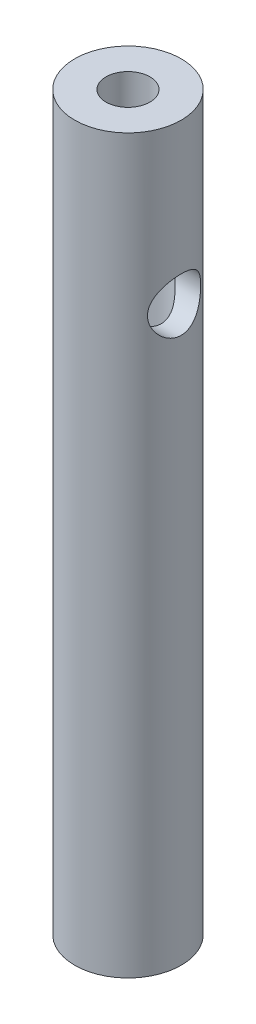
ISO-10303-21;
HEADER;
FILE_DESCRIPTION(('STEP AP214'),'2;1');
FILE_NAME('part.step','',(''),(''),'','','');
FILE_SCHEMA(('AUTOMOTIVE_DESIGN { 1 0 10303 214 1 1 1 1 }'));
ENDSEC;
DATA;
#1=APPLICATION_CONTEXT('core data for automotive mechanical design processes');
#2=APPLICATION_PROTOCOL_DEFINITION('international standard','automotive_design',2000,#1);
#3=PRODUCT_CONTEXT('',#1,'mechanical');
#4=PRODUCT('Part','Part','',(#3));
#5=PRODUCT_RELATED_PRODUCT_CATEGORY('part','',(#4));
#6=PRODUCT_DEFINITION_FORMATION('','',#4);
#7=PRODUCT_DEFINITION_CONTEXT('part definition',#1,'design');
#8=PRODUCT_DEFINITION('design','',#6,#7);
#9=PRODUCT_DEFINITION_SHAPE('','',#8);
#10=(LENGTH_UNIT() NAMED_UNIT(*) SI_UNIT(.MILLI.,.METRE.));
#11=(NAMED_UNIT(*) PLANE_ANGLE_UNIT() SI_UNIT($,.RADIAN.));
#12=(NAMED_UNIT(*) SI_UNIT($,.STERADIAN.) SOLID_ANGLE_UNIT());
#13=UNCERTAINTY_MEASURE_WITH_UNIT(LENGTH_MEASURE(1.E-05),#10,'distance_accuracy_value','');
#14=(GEOMETRIC_REPRESENTATION_CONTEXT(3) GLOBAL_UNCERTAINTY_ASSIGNED_CONTEXT((#13)) GLOBAL_UNIT_ASSIGNED_CONTEXT((#10,
#11,#12)) REPRESENTATION_CONTEXT('',''));
#15=CARTESIAN_POINT('',(0.,0.,0.));
#16=DIRECTION('',(0.,0.,1.));
#17=DIRECTION('',(1.,0.,0.));
#18=AXIS2_PLACEMENT_3D('',#15,#16,#17);
#19=CARTESIAN_POINT('',(0.,55.,0.));
#20=DIRECTION('',(0.,-1.,0.));
#21=DIRECTION('',(0.,0.,-1.));
#22=AXIS2_PLACEMENT_3D('',#19,#20,#21);
#23=CYLINDRICAL_SURFACE('',#22,4.);
#24=CARTESIAN_POINT('',(3.46410161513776,43.,-1.99999999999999));
#25=CARTESIAN_POINT('',(3.46411185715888,42.8957867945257,-1.9999915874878));
#26=CARTESIAN_POINT('',(3.46887633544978,42.7914378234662,-1.99179963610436));
#27=CARTESIAN_POINT('',(3.48724701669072,42.5859448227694,-1.95944672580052));
#28=CARTESIAN_POINT('',(3.50087179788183,42.4848079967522,-1.93525221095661));
#29=CARTESIAN_POINT('',(3.53498701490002,42.2890968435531,-1.8721998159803));
#30=CARTESIAN_POINT('',(3.55544089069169,42.1944907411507,-1.83341988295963));
#31=CARTESIAN_POINT('',(3.60085327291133,42.0131515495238,-1.74253507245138));
#32=CARTESIAN_POINT('',(3.62581202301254,41.9264188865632,-1.69042947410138));
#33=CARTESIAN_POINT('',(3.67993738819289,41.7553885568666,-1.569333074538));
#34=CARTESIAN_POINT('',(3.70928127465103,41.6718817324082,-1.49930407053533));
#35=CARTESIAN_POINT('',(3.76743965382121,41.5171832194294,-1.34650761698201));
#36=CARTESIAN_POINT('',(3.79625387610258,41.445997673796,-1.26373385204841));
#37=CARTESIAN_POINT('',(3.85242953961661,41.3132656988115,-1.08097912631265));
#38=CARTESIAN_POINT('',(3.87956212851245,41.2526924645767,-0.980214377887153));
#39=CARTESIAN_POINT('',(3.92701512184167,41.1497182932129,-0.768314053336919));
#40=CARTESIAN_POINT('',(3.94733982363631,41.1073058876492,-0.657185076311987));
#41=CARTESIAN_POINT('',(3.97760922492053,41.0449906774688,-0.436089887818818));
#42=CARTESIAN_POINT('',(3.98818960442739,41.0237009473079,-0.326603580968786));
#43=CARTESIAN_POINT('',(4.00015167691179,40.999667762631,-0.10514125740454));
#44=CARTESIAN_POINT('',(4.00153893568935,40.9969130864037,0.00683321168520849));
#45=CARTESIAN_POINT('',(3.99525963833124,41.0094933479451,0.219665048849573));
#46=CARTESIAN_POINT('',(3.98836991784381,41.0232760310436,0.320642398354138));
#47=CARTESIAN_POINT('',(3.96748490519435,41.0657616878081,0.518627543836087));
#48=CARTESIAN_POINT('',(3.95348908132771,41.0944657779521,0.6156350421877));
#49=CARTESIAN_POINT('',(3.91943166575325,41.16616513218,0.804618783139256));
#50=CARTESIAN_POINT('',(3.89928883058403,41.2093526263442,0.896506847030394));
#51=CARTESIAN_POINT('',(3.8547529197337,41.3085268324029,1.07195360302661));
#52=CARTESIAN_POINT('',(3.83035832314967,41.3645181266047,1.15550929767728));
#53=CARTESIAN_POINT('',(3.7768878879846,41.4937907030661,1.3203473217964));
#54=CARTESIAN_POINT('',(3.74758751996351,41.568206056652,1.40066815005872));
#55=CARTESIAN_POINT('',(3.68908681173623,41.7291794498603,1.54820874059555));
#56=CARTESIAN_POINT('',(3.65988656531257,41.8157467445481,1.61541842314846));
#57=CARTESIAN_POINT('',(3.60288312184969,42.0052963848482,1.73901066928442));
#58=CARTESIAN_POINT('',(3.57528639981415,42.1089720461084,1.7944346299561));
#59=CARTESIAN_POINT('',(3.52750900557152,42.325875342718,1.88663822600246));
#60=CARTESIAN_POINT('',(3.50732060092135,42.4390928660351,1.92343731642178));
#61=CARTESIAN_POINT('',(3.47889271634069,42.6624290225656,1.97436042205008));
#62=CARTESIAN_POINT('',(3.46983311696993,42.7720822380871,1.99005024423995));
#63=CARTESIAN_POINT('',(3.46235838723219,42.9928026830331,2.00303389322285));
#64=CARTESIAN_POINT('',(3.46393573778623,43.1038688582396,2.00034071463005));
#65=CARTESIAN_POINT('',(3.4766867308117,43.3113078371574,1.97807208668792));
#66=CARTESIAN_POINT('',(3.48679175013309,43.4079589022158,1.96037563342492));
#67=CARTESIAN_POINT('',(3.51388043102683,43.596735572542,1.91139256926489));
#68=CARTESIAN_POINT('',(3.53086632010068,43.6888597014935,1.88010155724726));
#69=CARTESIAN_POINT('',(3.57072444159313,43.8708226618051,1.80329517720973));
#70=CARTESIAN_POINT('',(3.59383286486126,43.960358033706,1.75718812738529));
#71=CARTESIAN_POINT('',(3.643122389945,44.130938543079,1.65257412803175));
#72=CARTESIAN_POINT('',(3.66930506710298,44.2119792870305,1.59406080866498));
#73=CARTESIAN_POINT('',(3.72575996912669,44.3739575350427,1.45767433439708));
#74=CARTESIAN_POINT('',(3.75613166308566,44.4535943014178,1.37829054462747));
#75=CARTESIAN_POINT('',(3.81468469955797,44.5988244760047,1.20680899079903));
#76=CARTESIAN_POINT('',(3.84286530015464,44.6644131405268,1.1147069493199));
#77=CARTESIAN_POINT('',(3.89482723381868,44.7811474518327,0.917070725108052));
#78=CARTESIAN_POINT('',(3.91847283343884,44.8318662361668,0.811246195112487));
#79=CARTESIAN_POINT('',(3.95766709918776,44.9142758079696,0.59104472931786));
#80=CARTESIAN_POINT('',(3.97322287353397,44.9459833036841,0.47667540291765));
#81=CARTESIAN_POINT('',(3.99335016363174,44.9867371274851,0.253959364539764));
#82=CARTESIAN_POINT('',(3.9987985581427,44.9975957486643,0.146022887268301));
#83=CARTESIAN_POINT('',(4.00084260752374,45.0016865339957,-0.0702519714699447));
#84=CARTESIAN_POINT('',(3.99744136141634,44.9949248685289,-0.178590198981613));
#85=CARTESIAN_POINT('',(3.98267937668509,44.9651671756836,-0.385075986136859));
#86=CARTESIAN_POINT('',(3.97185789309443,44.9432702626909,-0.483424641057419));
#87=CARTESIAN_POINT('',(3.94384187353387,44.8853460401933,-0.674891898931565));
#88=CARTESIAN_POINT('',(3.92664642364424,44.8493167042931,-0.768009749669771));
#89=CARTESIAN_POINT('',(3.8865186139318,44.7625457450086,-0.950846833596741));
#90=CARTESIAN_POINT('',(3.86337234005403,44.7112407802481,-1.0402503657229));
#91=CARTESIAN_POINT('',(3.81376266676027,44.5960847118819,-1.20954920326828));
#92=CARTESIAN_POINT('',(3.78729774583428,44.5322278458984,-1.28944011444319));
#93=CARTESIAN_POINT('',(3.73057218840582,44.3864033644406,-1.44582833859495));
#94=CARTESIAN_POINT('',(3.70019591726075,44.3032658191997,-1.52119665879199));
#95=CARTESIAN_POINT('',(3.64126158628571,44.1251077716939,-1.65732528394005));
#96=CARTESIAN_POINT('',(3.61270515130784,44.0300768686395,-1.71807266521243));
#97=CARTESIAN_POINT('',(3.55999186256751,43.8266911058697,-1.8248671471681));
#98=CARTESIAN_POINT('',(3.53600256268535,43.7180100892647,-1.87038902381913));
#99=CARTESIAN_POINT('',(3.5069621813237,43.5494218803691,-1.923959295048));
#100=CARTESIAN_POINT('',(3.49844389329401,43.4923521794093,-1.93935666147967));
#101=CARTESIAN_POINT('',(3.48406059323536,43.3767674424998,-1.96508069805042));
#102=CARTESIAN_POINT('',(3.47819372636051,43.3182534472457,-1.97541091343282));
#103=CARTESIAN_POINT('',(3.47059023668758,43.2163992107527,-1.9887293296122));
#104=CARTESIAN_POINT('',(3.46816389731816,43.1732669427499,-1.99295091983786));
#105=CARTESIAN_POINT('',(3.46491740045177,43.0867643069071,-1.99858810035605));
#106=CARTESIAN_POINT('',(3.46409735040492,43.0433939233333,-2.00000350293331));
#107=CARTESIAN_POINT('',(3.46410161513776,43.,-1.99999999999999));
#108=B_SPLINE_CURVE_WITH_KNOTS('',3,(#24,#25,#26,#27,#28,#29,#30,#31,#32,#33,#34,#35,#36,#37,
#38,#39,#40,#41,#42,#43,#44,#45,#46,#47,#48,#49,#50,#51,#52,#53,#54,#55,#56,#57,#58,#59,#60,#61,
#62,#63,#64,#65,#66,#67,#68,#69,#70,#71,#72,#73,#74,#75,#76,#77,#78,#79,#80,#81,#82,#83,#84,#85,
#86,#87,#88,#89,#90,#91,#92,#93,#94,#95,#96,#97,#98,#99,#100,#101,#102,#103,#104,#105,#106,
#107),.UNSPECIFIED.,.T.,.F.,(4,2,2,2,2,2,2,2,2,2,2,2,2,2,2,2,2,2,2,2,2,2,2,2,2,2,2,2,2,2,2,2,2,
2,2,2,2,2,2,2,2,4),(0.,0.312464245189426,0.62558578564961,0.937057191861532,1.24854545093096,
1.58572462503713,1.92307142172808,2.28315784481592,2.64301653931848,2.97726969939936,
3.31132047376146,3.61632194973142,3.92134625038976,4.23059069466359,4.53994598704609,
4.87854382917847,5.21740096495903,5.57777683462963,5.93777548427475,6.26924581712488,
6.60048186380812,6.89548366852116,7.19058104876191,7.4993459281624,7.8082697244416,
8.15613487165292,8.5041172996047,8.86128362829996,9.21813559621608,9.54224540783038,
9.86624173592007,10.1688884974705,10.4715786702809,10.7872150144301,11.102996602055,
11.450204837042,11.7977188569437,12.1562149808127,12.3351395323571,12.5139387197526,
12.6440387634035,12.7741475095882),.UNSPECIFIED.);
#109=CARTESIAN_POINT('',(3.46410161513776,43.,-1.99999999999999));
#110=VERTEX_POINT('',#109);
#111=EDGE_CURVE('E63',#110,#110,#108,.T.);
#112=ORIENTED_EDGE('',*,*,#111,.T.);
#113=EDGE_LOOP('',(#112));
#114=FACE_BOUND('',#113,.T.);
#115=CARTESIAN_POINT('',(0.,55.,0.));
#116=DIRECTION('',(0.,1.,0.));
#117=DIRECTION('',(0.,0.,1.));
#118=AXIS2_PLACEMENT_3D('',#115,#116,#117);
#119=CIRCLE('',#118,4.);
#120=CARTESIAN_POINT('',(0.,55.,4.));
#121=VERTEX_POINT('',#120);
#122=EDGE_CURVE('E47',#121,#121,#119,.T.);
#123=ORIENTED_EDGE('',*,*,#122,.F.);
#124=EDGE_LOOP('',(#123));
#125=FACE_BOUND('',#124,.T.);
#126=CARTESIAN_POINT('',(0.,0.,0.));
#127=DIRECTION('',(0.,1.,0.));
#128=DIRECTION('',(0.,0.,1.));
#129=AXIS2_PLACEMENT_3D('',#126,#127,#128);
#130=CIRCLE('',#129,4.);
#131=CARTESIAN_POINT('',(0.,0.,4.));
#132=VERTEX_POINT('',#131);
#133=EDGE_CURVE('E103',#132,#132,#130,.T.);
#134=ORIENTED_EDGE('',*,*,#133,.T.);
#135=EDGE_LOOP('',(#134));
#136=FACE_BOUND('',#135,.T.);
#137=ADVANCED_FACE('F36',(#114,#125,#136),#23,.T.);
#138=CARTESIAN_POINT('',(0.,55.,0.));
#139=DIRECTION('',(0.,1.,0.));
#140=DIRECTION('',(0.,0.,1.));
#141=AXIS2_PLACEMENT_3D('',#138,#139,#140);
#142=PLANE('',#141);
#143=CARTESIAN_POINT('',(0.,55.,0.));
#144=DIRECTION('',(0.,1.,0.));
#145=DIRECTION('',(0.,0.,1.));
#146=AXIS2_PLACEMENT_3D('',#143,#144,#145);
#147=CIRCLE('',#146,1.64999999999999);
#148=CARTESIAN_POINT('',(0.,55.,1.64999999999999));
#149=VERTEX_POINT('',#148);
#150=EDGE_CURVE('E68',#149,#149,#147,.T.);
#151=ORIENTED_EDGE('',*,*,#150,.F.);
#152=EDGE_LOOP('',(#151));
#153=FACE_BOUND('',#152,.T.);
#154=ORIENTED_EDGE('',*,*,#122,.T.);
#155=EDGE_LOOP('',(#154));
#156=FACE_BOUND('',#155,.T.);
#157=ADVANCED_FACE('F83',(#153,#156),#142,.T.);
#158=CARTESIAN_POINT('',(0.,0.,0.));
#159=DIRECTION('',(0.,1.,0.));
#160=DIRECTION('',(0.,0.,1.));
#161=AXIS2_PLACEMENT_3D('',#158,#159,#160);
#162=PLANE('',#161);
#163=CARTESIAN_POINT('',(0.,0.,0.));
#164=DIRECTION('',(0.,-1.,0.));
#165=DIRECTION('',(0.,0.,-1.));
#166=AXIS2_PLACEMENT_3D('',#163,#164,#165);
#167=CIRCLE('',#166,2.5);
#168=CARTESIAN_POINT('',(0.,0.,-2.5));
#169=VERTEX_POINT('',#168);
#170=EDGE_CURVE('E58',#169,#169,#167,.T.);
#171=ORIENTED_EDGE('',*,*,#170,.F.);
#172=EDGE_LOOP('',(#171));
#173=FACE_BOUND('',#172,.T.);
#174=ORIENTED_EDGE('',*,*,#133,.F.);
#175=EDGE_LOOP('',(#174));
#176=FACE_BOUND('',#175,.T.);
#177=ADVANCED_FACE('F81',(#173,#176),#162,.F.);
#178=CARTESIAN_POINT('',(0.,55.,0.));
#179=DIRECTION('',(0.,1.,0.));
#180=DIRECTION('',(0.,0.,1.));
#181=AXIS2_PLACEMENT_3D('',#178,#179,#180);
#182=CYLINDRICAL_SURFACE('',#181,1.64999999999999);
#183=CARTESIAN_POINT('',(0.,45.5107315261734,0.));
#184=DIRECTION('',(0.,-1.,0.));
#185=DIRECTION('',(0.,0.,-1.));
#186=AXIS2_PLACEMENT_3D('',#183,#184,#185);
#187=CIRCLE('',#186,1.64999999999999);
#188=CARTESIAN_POINT('',(0.,45.5107315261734,-1.64999999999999));
#189=VERTEX_POINT('',#188);
#190=EDGE_CURVE('E55',#189,#189,#187,.T.);
#191=ORIENTED_EDGE('',*,*,#190,.T.);
#192=EDGE_LOOP('',(#191));
#193=FACE_BOUND('',#192,.T.);
#194=ORIENTED_EDGE('',*,*,#150,.T.);
#195=EDGE_LOOP('',(#194));
#196=FACE_BOUND('',#195,.T.);
#197=ADVANCED_FACE('F74',(#193,#196),#182,.F.);
#198=CARTESIAN_POINT('',(4.,43.,0.));
#199=DIRECTION('',(1.,0.,0.));
#200=DIRECTION('',(0.,0.,-1.));
#201=AXIS2_PLACEMENT_3D('',#198,#199,#200);
#202=CYLINDRICAL_SURFACE('',#201,1.99999999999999);
#203=CARTESIAN_POINT('',(1.5,43.,-1.99999999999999));
#204=CARTESIAN_POINT('',(1.5000227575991,42.9249189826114,-1.99998995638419));
#205=CARTESIAN_POINT('',(1.50575588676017,42.8497210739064,-1.99572243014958));
#206=CARTESIAN_POINT('',(1.52759797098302,42.7016854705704,-1.97904350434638));
#207=CARTESIAN_POINT('',(1.54374252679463,42.6288567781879,-1.96660415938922));
#208=CARTESIAN_POINT('',(1.59078313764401,42.4623945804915,-1.92888289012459));
#209=CARTESIAN_POINT('',(1.62485949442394,42.3703574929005,-1.90063587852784));
#210=CARTESIAN_POINT('',(1.70094533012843,42.1940318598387,-1.83286412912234));
#211=CARTESIAN_POINT('',(1.74297705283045,42.1097660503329,-1.79330760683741));
#212=CARTESIAN_POINT('',(1.84624966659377,41.9196603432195,-1.68777756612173));
#213=CARTESIAN_POINT('',(1.90894188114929,41.8170334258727,-1.61742363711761));
#214=CARTESIAN_POINT('',(2.03287996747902,41.6260231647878,-1.4586193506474));
#215=CARTESIAN_POINT('',(2.09412699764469,41.5376280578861,-1.37018407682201));
#216=CARTESIAN_POINT('',(2.19790674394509,41.3928950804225,-1.19476026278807));
#217=CARTESIAN_POINT('',(2.24174680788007,41.3336737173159,-1.1109337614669));
#218=CARTESIAN_POINT('',(2.32165152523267,41.2276340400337,-0.93244475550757));
#219=CARTESIAN_POINT('',(2.35772824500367,41.1807964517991,-0.837799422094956));
#220=CARTESIAN_POINT('',(2.41415644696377,41.1082870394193,-0.655317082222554));
#221=CARTESIAN_POINT('',(2.43610736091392,41.0804174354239,-0.5688535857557));
#222=CARTESIAN_POINT('',(2.47085912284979,41.036501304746,-0.391188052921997));
#223=CARTESIAN_POINT('',(2.48366497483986,41.02044831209,-0.299988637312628));
#224=CARTESIAN_POINT('',(2.49907968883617,41.0011419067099,-0.115048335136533));
#225=CARTESIAN_POINT('',(2.50165324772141,40.9979328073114,-0.0212997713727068));
#226=CARTESIAN_POINT('',(2.49626936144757,41.0046642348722,0.165416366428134));
#227=CARTESIAN_POINT('',(2.48831142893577,41.0146053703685,0.258383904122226));
#228=CARTESIAN_POINT('',(2.4632836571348,41.046067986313,0.435683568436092));
#229=CARTESIAN_POINT('',(2.44673404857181,41.0669288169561,0.520210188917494));
#230=CARTESIAN_POINT('',(2.40604493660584,41.1186952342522,0.684171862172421));
#231=CARTESIAN_POINT('',(2.38190351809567,41.1496033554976,0.763605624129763));
#232=CARTESIAN_POINT('',(2.32486221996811,41.2236006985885,0.923527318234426));
#233=CARTESIAN_POINT('',(2.29134265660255,41.2675765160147,1.00337969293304));
#234=CARTESIAN_POINT('',(2.21894043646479,41.3645378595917,1.15470891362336));
#235=CARTESIAN_POINT('',(2.18005477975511,41.4175284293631,1.22618103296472));
#236=CARTESIAN_POINT('',(2.09053510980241,41.5430618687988,1.37426521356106));
#237=CARTESIAN_POINT('',(2.03913144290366,41.6173836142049,1.44890108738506));
#238=CARTESIAN_POINT('',(1.9349237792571,41.7762559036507,1.58538384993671));
#239=CARTESIAN_POINT('',(1.88211814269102,41.8608188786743,1.6472149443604));
#240=CARTESIAN_POINT('',(1.78441317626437,42.0312201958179,1.75228528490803));
#241=CARTESIAN_POINT('',(1.739242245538,42.1161509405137,1.79674173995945));
#242=CARTESIAN_POINT('',(1.65582105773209,42.2943664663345,1.87389106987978));
#243=CARTESIAN_POINT('',(1.61755576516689,42.3876324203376,1.90660965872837));
#244=CARTESIAN_POINT('',(1.56393805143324,42.5527916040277,1.95062199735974));
#245=CARTESIAN_POINT('',(1.54515601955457,42.6226128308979,1.96540293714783));
#246=CARTESIAN_POINT('',(1.51667304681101,42.7651802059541,1.98746978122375));
#247=CARTESIAN_POINT('',(1.50695186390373,42.8379194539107,1.99477239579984));
#248=CARTESIAN_POINT('',(1.49827790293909,42.9848633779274,2.0012999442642));
#249=CARTESIAN_POINT('',(1.49938753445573,43.0590740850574,2.00047806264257));
#250=CARTESIAN_POINT('',(1.51230456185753,43.2060473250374,1.99072610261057));
#251=CARTESIAN_POINT('',(1.52412705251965,43.2788076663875,1.98178458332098));
#252=CARTESIAN_POINT('',(1.56051508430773,43.4390632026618,1.95331430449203));
#253=CARTESIAN_POINT('',(1.58755721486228,43.5255982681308,1.9316709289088));
#254=CARTESIAN_POINT('',(1.65022809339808,43.6922908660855,1.87841388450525));
#255=CARTESIAN_POINT('',(1.68588236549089,43.7724284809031,1.84677049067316));
#256=CARTESIAN_POINT('',(1.77903249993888,43.9615289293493,1.75807608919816));
#257=CARTESIAN_POINT('',(1.83905564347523,44.0668953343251,1.69602510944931));
#258=CARTESIAN_POINT('',(1.96026853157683,44.264384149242,1.55438039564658));
#259=CARTESIAN_POINT('',(2.02145957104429,44.3564907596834,1.47476601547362));
#260=CARTESIAN_POINT('',(2.13993299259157,44.527462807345,1.29702304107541));
#261=CARTESIAN_POINT('',(2.1971478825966,44.6061226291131,1.19864860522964));
#262=CARTESIAN_POINT('',(2.30083046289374,44.7452665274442,0.984970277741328));
#263=CARTESIAN_POINT('',(2.3473329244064,44.8058096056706,0.869723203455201));
#264=CARTESIAN_POINT('',(2.41163161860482,44.8884905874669,0.664531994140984));
#265=CARTESIAN_POINT('',(2.43384921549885,44.9167173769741,0.578408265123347));
#266=CARTESIAN_POINT('',(2.46921550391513,44.961432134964,0.401365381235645));
#267=CARTESIAN_POINT('',(2.48237111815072,44.9779290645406,0.310449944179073));
#268=CARTESIAN_POINT('',(2.49854699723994,44.9981928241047,0.125961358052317));
#269=CARTESIAN_POINT('',(2.50153028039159,45.0019132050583,0.0323797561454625));
#270=CARTESIAN_POINT('',(2.4969871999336,44.9962334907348,-0.15412949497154));
#271=CARTESIAN_POINT('',(2.48946009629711,44.9868324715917,-0.247057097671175));
#272=CARTESIAN_POINT('',(2.46524008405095,44.9563964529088,-0.424484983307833));
#273=CARTESIAN_POINT('',(2.44905900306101,44.9360106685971,-0.509170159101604));
#274=CARTESIAN_POINT('',(2.4090520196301,44.8851465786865,-0.673520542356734));
#275=CARTESIAN_POINT('',(2.38522413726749,44.854665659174,-0.753184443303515));
#276=CARTESIAN_POINT('',(2.32886203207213,44.7816254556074,-0.913383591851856));
#277=CARTESIAN_POINT('',(2.29572397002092,44.738206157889,-0.993310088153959));
#278=CARTESIAN_POINT('',(2.22403396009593,44.6423576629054,-1.14486396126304));
#279=CARTESIAN_POINT('',(2.18547913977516,44.5899236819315,-1.21648689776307));
#280=CARTESIAN_POINT('',(2.0966685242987,44.4657037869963,-1.36488223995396));
#281=CARTESIAN_POINT('',(2.04563299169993,44.3921535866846,-1.43970803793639));
#282=CARTESIAN_POINT('',(1.9420131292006,44.2348830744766,-1.57669353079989));
#283=CARTESIAN_POINT('',(1.88942694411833,44.1511501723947,-1.63883728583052));
#284=CARTESIAN_POINT('',(1.79109125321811,43.9810424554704,-1.74551261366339));
#285=CARTESIAN_POINT('',(1.74513263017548,43.8954274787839,-1.79106140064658));
#286=CARTESIAN_POINT('',(1.66007449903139,43.7156081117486,-1.8701630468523));
#287=CARTESIAN_POINT('',(1.6209622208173,43.6214202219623,-1.90373836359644));
#288=CARTESIAN_POINT('',(1.56580101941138,43.4538606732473,-1.94914139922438));
#289=CARTESIAN_POINT('',(1.54635220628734,43.3825804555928,-1.96446470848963));
#290=CARTESIAN_POINT('',(1.51695472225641,43.2369757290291,-1.98726282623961));
#291=CARTESIAN_POINT('',(1.50696990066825,43.162663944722,-1.99476751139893));
#292=CARTESIAN_POINT('',(1.50085460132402,43.0586747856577,-1.9993574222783));
#293=CARTESIAN_POINT('',(1.49999110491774,43.0293463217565,-2.00000392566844));
#294=CARTESIAN_POINT('',(1.5,43.,-1.99999999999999));
#295=B_SPLINE_CURVE_WITH_KNOTS('',3,(#203,#204,#205,#206,#207,#208,#209,#210,#211,#212,#213,
#214,#215,#216,#217,#218,#219,#220,#221,#222,#223,#224,#225,#226,#227,#228,#229,#230,#231,#232,
#233,#234,#235,#236,#237,#238,#239,#240,#241,#242,#243,#244,#245,#246,#247,#248,#249,#250,#251,
#252,#253,#254,#255,#256,#257,#258,#259,#260,#261,#262,#263,#264,#265,#266,#267,#268,#269,#270,
#271,#272,#273,#274,#275,#276,#277,#278,#279,#280,#281,#282,#283,#284,#285,#286,#287,#288,#289,
#290,#291,#292,#293,#294),.UNSPECIFIED.,.T.,.F.,(4,2,2,2,2,2,2,2,2,2,2,2,2,2,2,2,2,2,2,2,2,2,2,
2,2,2,2,2,2,2,2,2,2,2,2,2,2,2,2,2,2,2,2,2,2,4),(0.,0.22514081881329,0.451055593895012,
0.755714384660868,1.06123795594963,1.47720804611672,1.89283253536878,2.22639303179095,
2.55943127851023,2.83862094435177,3.11765772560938,3.39765639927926,3.67766803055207,
3.94241917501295,4.20723715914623,4.49756510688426,4.78805602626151,5.13841226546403,
5.48919811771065,5.80619193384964,6.12248701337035,6.34307726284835,6.56317352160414,
6.78453876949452,7.00621641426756,7.28428560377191,7.56318925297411,7.96975811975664,
8.37680748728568,8.78961174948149,9.2010566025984,9.47985927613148,9.75844872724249,
10.0380499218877,10.3176708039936,10.5823344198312,10.8470666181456,11.1364335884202,
11.4259545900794,11.7747351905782,12.1239515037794,12.444957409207,12.7653580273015,
12.9909138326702,13.2156045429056,13.3036035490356),.UNSPECIFIED.);
#296=CARTESIAN_POINT('',(2.49999999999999,45.,0.));
#297=VERTEX_POINT('',#296);
#298=EDGE_CURVE('E11',#297,#297,#295,.T.);
#299=ORIENTED_EDGE('',*,*,#298,.T.);
#300=EDGE_LOOP('',(#299));
#301=FACE_BOUND('',#300,.T.);
#302=ORIENTED_EDGE('',*,*,#111,.F.);
#303=EDGE_LOOP('',(#302));
#304=FACE_BOUND('',#303,.T.);
#305=ADVANCED_FACE('F70',(#301,#304),#202,.F.);
#306=CARTESIAN_POINT('',(0.,0.,0.));
#307=DIRECTION('',(0.,-1.,0.));
#308=DIRECTION('',(0.,0.,-1.));
#309=AXIS2_PLACEMENT_3D('',#306,#307,#308);
#310=CYLINDRICAL_SURFACE('',#309,2.5);
#311=ORIENTED_EDGE('',*,*,#170,.T.);
#312=EDGE_LOOP('',(#311));
#313=FACE_BOUND('',#312,.T.);
#314=CARTESIAN_POINT('',(0.,45.,0.));
#315=DIRECTION('',(0.,-1.,0.));
#316=DIRECTION('',(0.,0.,-1.));
#317=AXIS2_PLACEMENT_3D('',#314,#315,#316);
#318=CIRCLE('',#317,2.49999999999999);
#319=EDGE_CURVE('E52',#297,#297,#318,.T.);
#320=ORIENTED_EDGE('',*,*,#319,.F.);
#321=ORIENTED_EDGE('',*,*,#298,.F.);
#322=EDGE_LOOP('',(#320,#321));
#323=FACE_BOUND('',#322,.T.);
#324=ADVANCED_FACE('F53',(#313,#323),#310,.F.);
#325=CARTESIAN_POINT('',(0.,45.,0.));
#326=DIRECTION('',(0.,-1.,0.));
#327=DIRECTION('',(0.,0.,-1.));
#328=AXIS2_PLACEMENT_3D('',#325,#326,#327);
#329=CONICAL_SURFACE('',#328,2.49999999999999,1.02974425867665);
#330=ORIENTED_EDGE('',*,*,#319,.T.);
#331=EDGE_LOOP('',(#330));
#332=FACE_BOUND('',#331,.T.);
#333=ORIENTED_EDGE('',*,*,#190,.F.);
#334=EDGE_LOOP('',(#333));
#335=FACE_BOUND('',#334,.T.);
#336=ADVANCED_FACE('F140',(#332,#335),#329,.F.);
#337=CLOSED_SHELL('',(#137,#157,#177,#197,#305,#324,#336));
#338=MANIFOLD_SOLID_BREP('B2',#337);
#339=ADVANCED_BREP_SHAPE_REPRESENTATION('',(#18,#338),#14);
#340=SHAPE_DEFINITION_REPRESENTATION(#9,#339);
ENDSEC;
END-ISO-10303-21;
